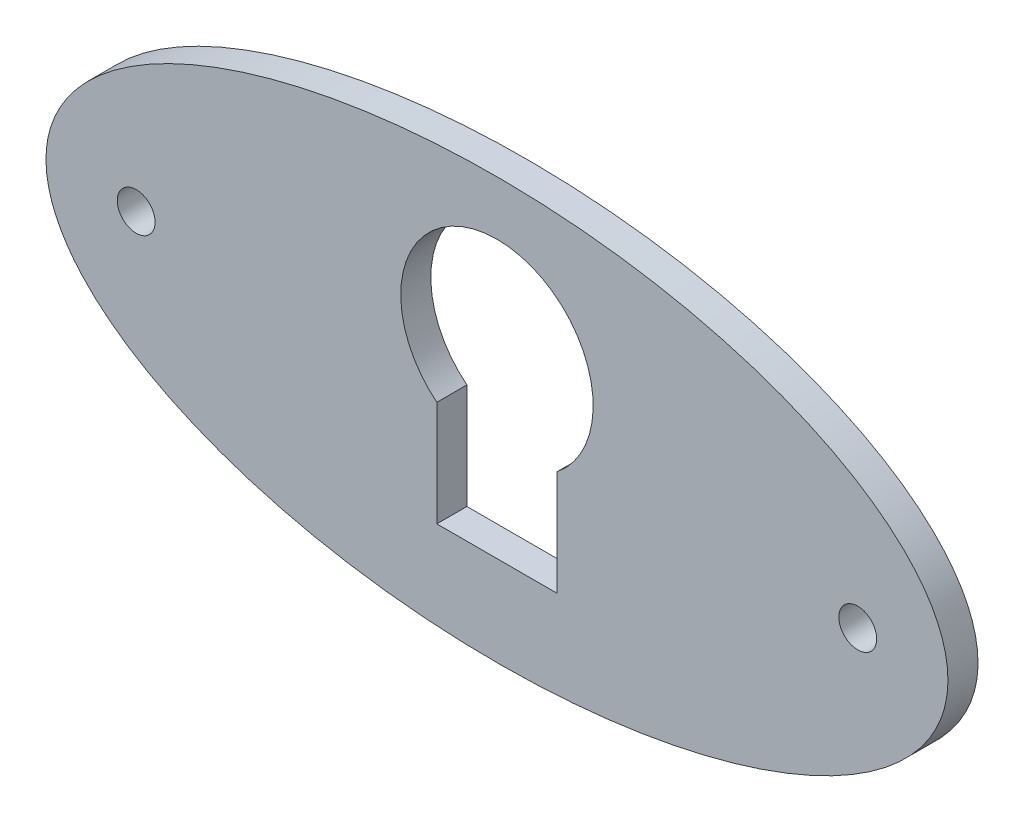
from build123d import *

# Parameters (mm, degrees)
SKETCH1_RX                   = 11.90625
SKETCH1_RY                   = 5.55625
EXTRUDE1_DEPTH               = 0.79375
EXTRUDE2_DEPTH               = 14.162854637
F_1_0_1_DIAMETER_HOLE1_D     = 1
F_1_0_1_DIAMETER_HOLE1_DEPTH = 10.0076
F_1_0_1_DIAMETER_HOLE1_TIP   = 0.30043031


with BuildPart() as part:
    # Sketch1 → Extrude1 (new body)
    with BuildSketch(Plane.XY):
        with Locations((0, 0)):
            Ellipse(SKETCH1_RX, SKETCH1_RY)
    extrude(amount=-EXTRUDE1_DEPTH)

    # Sketch2 → Extrude2 (cut, through all)
    with BuildSketch(Plane.XY):
        with BuildLine():
            Line((1.5875, -0.395286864), (1.5875, -3.175))
            Line((1.5875, -3.175), (-1.5875, -3.175))
            Line((-1.5875, -3.175), (-1.5875, -0.395286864))
            ThreePointArc((-1.5875, -0.395286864), (0, 4.1275), (1.5875, -0.395286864))
        make_face()
    extrude(amount=-EXTRUDE2_DEPTH, mode=Mode.SUBTRACT)

    # 1.0 _1_ Diameter Hole1
    with Locations(Plane.XY):
        with Locations((-9.525, 0), (9.525, 0)):
            Hole(F_1_0_1_DIAMETER_HOLE1_D / 2, depth=F_1_0_1_DIAMETER_HOLE1_DEPTH)
            with Locations((0, 0, -(F_1_0_1_DIAMETER_HOLE1_DEPTH + F_1_0_1_DIAMETER_HOLE1_TIP / 2))):  # 118° drill point
                Cone(0, F_1_0_1_DIAMETER_HOLE1_D / 2, F_1_0_1_DIAMETER_HOLE1_TIP, mode=Mode.SUBTRACT)


solid = part.part
